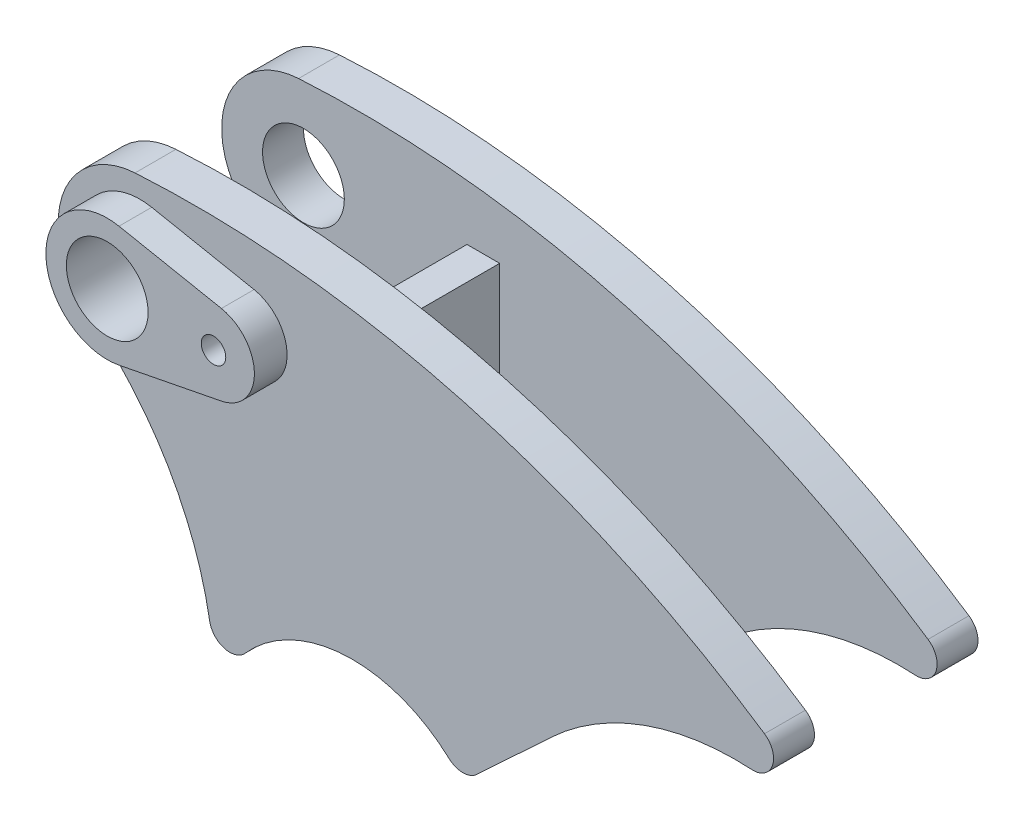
from build123d import *

# Parameters (mm, degrees)
EXTRUDE_START       = 15
EXTRUDE_1_DEPTH     = 10
EXTRUDE_START_2     = -25
EXTRUDE_2_DEPTH     = 10
SKETCH_3_W          = 8
SKETCH_3_H          = 40
EXTRUDE_3_DEPTH     = 40
EXTRUDE_4_DEPTH     = 8
SKETCH_5_R          = 10
CUT_EXTRUDE_1_DEPTH = 180.691402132
SKETCH_6_R          = 3
CUT_EXTRUDE_2_DEPTH = 20


with BuildPart() as part:
    # Sketch 1 → Extrude 1 (new body)
    with BuildSketch(Plane.XY.offset(EXTRUDE_START)):
        with BuildLine():
            Line((82.4099918, -65.656768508), (100.693834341, -48.606809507))
            ThreePointArc((100.693834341, -48.606809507), (123.385617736, -34.764860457), (149.697586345, -30.996983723))
            ThreePointArc((149.697586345, -30.996983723), (154.73786832, -27.603824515), (152.781650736, -21.851330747))
            ThreePointArc((152.781650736, -21.851330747), (79.220607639, 11.669463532), (-1.191227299, 19.964492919))
            ThreePointArc((-1.191227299, 19.964492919), (-19.048503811, 6.095449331), (-12.560235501, -15.564076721))
            ThreePointArc((-12.560235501, -15.564076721), (6.82519428, -38.021140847), (17.074703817, -65.861079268))
            ThreePointArc((17.074703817, -65.861079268), (20.640645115, -69.811668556), (25.74663181, -68.311004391))
            ThreePointArc((25.74663181, -68.311004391), (50.133495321, -56.536411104), (75.62163181, -65.686004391))
            ThreePointArc((75.62163181, -65.686004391), (79.021533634, -66.99995363), (82.4099918, -65.656768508))
        make_face()
    extrude(amount=EXTRUDE_1_DEPTH)



with BuildPart() as body_2:
    # Sketch 2 → Extrude 2 (new body)
    with BuildSketch(Plane.XY.offset(EXTRUDE_START_2)):
        with BuildLine():
            Line((82.4099918, -65.656768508), (100.693834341, -48.606809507))
            ThreePointArc((100.693834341, -48.606809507), (123.385617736, -34.764860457), (149.697586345, -30.996983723))
            ThreePointArc((149.697586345, -30.996983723), (154.73786832, -27.603824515), (152.781650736, -21.851330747))
            ThreePointArc((152.781650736, -21.851330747), (79.220607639, 11.669463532), (-1.191227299, 19.964492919))
            ThreePointArc((-1.191227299, 19.964492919), (-19.048503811, 6.095449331), (-12.560235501, -15.564076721))
            ThreePointArc((-12.560235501, -15.564076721), (6.82519428, -38.021140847), (17.074703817, -65.861079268))
            ThreePointArc((17.074703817, -65.861079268), (20.640645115, -69.811668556), (25.74663181, -68.311004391))
            ThreePointArc((25.74663181, -68.311004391), (50.133495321, -56.536411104), (75.62163181, -65.686004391))
            ThreePointArc((75.62163181, -65.686004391), (79.021533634, -66.99995363), (82.4099918, -65.656768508))
        make_face()
    extrude(amount=EXTRUDE_2_DEPTH)


with BuildPart() as part_1:
    add(part.part)

    add(body_2.part)  # Extrude 3 merges body 2
    # Sketch 3 → Extrude 3 (add)
    with BuildSketch(Plane.XY.offset(25)):
        with Locations((44, -14.591668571)):
            Rectangle(SKETCH_3_W, SKETCH_3_H)
    extrude(amount=-EXTRUDE_3_DEPTH)

    # Sketch 4 → Extrude 4 (add)
    with BuildSketch(Plane.XY.offset(25)):
        with BuildLine():
            Line((2.884615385, 14.720020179), (27.923076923, 9.813346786))
            ThreePointArc((27.923076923, 9.813346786), (36, 0), (27.923076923, -9.813346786))
            Line((27.923076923, -9.813346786), (2.884615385, -14.720020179))
            ThreePointArc((2.884615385, -14.720020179), (-15, 0), (2.884615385, 14.720020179))
        make_face()
    extrude(amount=EXTRUDE_4_DEPTH)

    # Sketch 5 → Cut-Extrude 1 (cut, through all)
    with BuildSketch(Plane.XY.offset(33)):
        Circle(SKETCH_5_R)
    extrude(amount=-CUT_EXTRUDE_1_DEPTH, mode=Mode.SUBTRACT)

    # Sketch 6 → Cut-Extrude 2 (cut)
    with BuildSketch(Plane.XY.offset(33)):
        with Locations((26, 0)):
            Circle(SKETCH_6_R)
    extrude(amount=-CUT_EXTRUDE_2_DEPTH, mode=Mode.SUBTRACT)


solid = part_1.part
